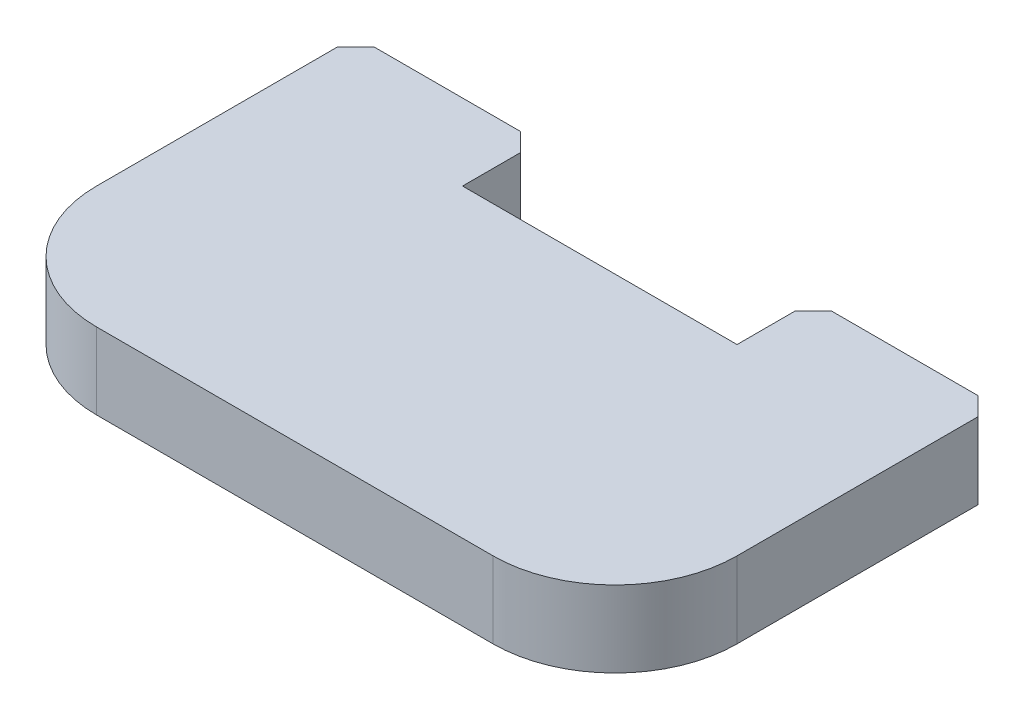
from build123d import *

# Parameters (mm, degrees)
SKETCH1_W           = 26.67
SKETCH1_H           = 15.875
BOSS_EXTRUDE1_DEPTH = 3.175
SKETCH2_W           = 11.43
SKETCH2_H           = 6.35
CUT_EXTRUDE1_DEPTH  = 16.840036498
CHAMFER1_SIZE       = 0.762
FILLET1_R           = 5.08


with BuildPart() as part:
    # Sketch1 → Boss-Extrude1 (new body)
    with BuildSketch(Plane(origin=(0, 0, 0), x_dir=(1, 0, 0), z_dir=(0, 1, 0))):
        Rectangle(SKETCH1_W, SKETCH1_H)
    extrude(amount=BOSS_EXTRUDE1_DEPTH)

    # Sketch2 → Cut-Extrude1 (cut, through all)
    with BuildSketch(Plane(origin=(0, 3.175, 0), x_dir=(1, 0, 0), z_dir=(0, 1, 0))):
        with Locations((0, 7.9375)):
            Rectangle(SKETCH2_W, SKETCH2_H)
    extrude(amount=-CUT_EXTRUDE1_DEPTH, mode=Mode.SUBTRACT)

    # Chamfer1
    chamfer1_edges = [part.edges().sort_by_distance(p)[0] for p in [
        (5.715, 1.5875, -7.9375),
        (-5.715, 1.5875, -7.9375),
        (-13.335, 1.5875, -7.9375),
        (13.335, 1.5875, -7.9375),
    ]]
    chamfer(chamfer1_edges, length=CHAMFER1_SIZE)

    # Fillet1
    fillet1_edges = [part.edges().sort_by_distance(p)[0] for p in [
        (13.335, 1.5875, 7.9375),
        (-13.335, 1.5875, 7.9375),
    ]]
    fillet(fillet1_edges, radius=FILLET1_R)


solid = part.part
